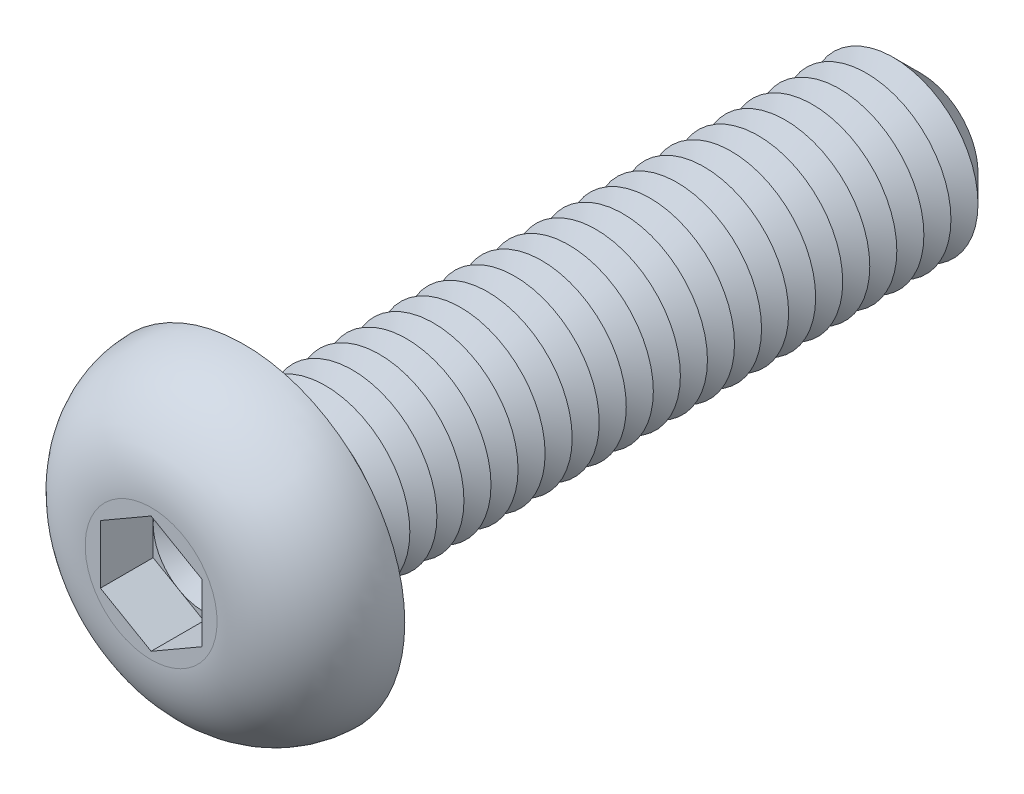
ISO-10303-21;
HEADER;
FILE_DESCRIPTION(('STEP AP214'),'2;1');
FILE_NAME('part.step','',(''),(''),'','','');
FILE_SCHEMA(('AUTOMOTIVE_DESIGN { 1 0 10303 214 1 1 1 1 }'));
ENDSEC;
DATA;
#1=APPLICATION_CONTEXT('core data for automotive mechanical design processes');
#2=APPLICATION_PROTOCOL_DEFINITION('international standard','automotive_design',2000,#1);
#3=PRODUCT_CONTEXT('',#1,'mechanical');
#4=PRODUCT('Part','Part','',(#3));
#5=PRODUCT_RELATED_PRODUCT_CATEGORY('part','',(#4));
#6=PRODUCT_DEFINITION_FORMATION('','',#4);
#7=PRODUCT_DEFINITION_CONTEXT('part definition',#1,'design');
#8=PRODUCT_DEFINITION('design','',#6,#7);
#9=PRODUCT_DEFINITION_SHAPE('','',#8);
#10=(LENGTH_UNIT() NAMED_UNIT(*) SI_UNIT(.MILLI.,.METRE.));
#11=(NAMED_UNIT(*) PLANE_ANGLE_UNIT() SI_UNIT($,.RADIAN.));
#12=(NAMED_UNIT(*) SI_UNIT($,.STERADIAN.) SOLID_ANGLE_UNIT());
#13=UNCERTAINTY_MEASURE_WITH_UNIT(LENGTH_MEASURE(1.E-05),#10,'distance_accuracy_value','');
#14=(GEOMETRIC_REPRESENTATION_CONTEXT(3) GLOBAL_UNCERTAINTY_ASSIGNED_CONTEXT((#13)) GLOBAL_UNIT_ASSIGNED_CONTEXT((#10,
#11,#12)) REPRESENTATION_CONTEXT('',''));
#15=CARTESIAN_POINT('',(0.,0.,0.));
#16=DIRECTION('',(0.,0.,1.));
#17=DIRECTION('',(1.,0.,0.));
#18=AXIS2_PLACEMENT_3D('',#15,#16,#17);
#19=CARTESIAN_POINT('',(0.,0.,1.19));
#20=DIRECTION('',(0.,0.,1.));
#21=DIRECTION('',(1.,0.,0.));
#22=AXIS2_PLACEMENT_3D('',#19,#20,#21);
#23=PLANE('',#22);
#24=CARTESIAN_POINT('',(0.,0.,1.19));
#25=DIRECTION('',(0.,0.,1.));
#26=DIRECTION('',(1.,0.,0.));
#27=AXIS2_PLACEMENT_3D('',#24,#25,#26);
#28=CIRCLE('',#27,1.5);
#29=CARTESIAN_POINT('',(1.5,0.,1.19));
#30=VERTEX_POINT('',#29);
#31=CARTESIAN_POINT('',(0.75,1.29903810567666,1.19));
#32=VERTEX_POINT('',#31);
#33=EDGE_CURVE('E117',#30,#32,#28,.T.);
#34=ORIENTED_EDGE('',*,*,#33,.F.);
#35=DIRECTION('',(0.,1.,0.));
#36=VECTOR('',#35,1.);
#37=CARTESIAN_POINT('',(1.5,-0.866025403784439,1.19));
#38=LINE('',#37,#36);
#39=CARTESIAN_POINT('',(1.5,0.86602540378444,1.19));
#40=VERTEX_POINT('',#39);
#41=EDGE_CURVE('E140',#30,#40,#38,.T.);
#42=ORIENTED_EDGE('',*,*,#41,.T.);
#43=DIRECTION('',(-0.866025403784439,0.5,0.));
#44=VECTOR('',#43,1.);
#45=CARTESIAN_POINT('',(1.5,0.86602540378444,1.19));
#46=LINE('',#45,#44);
#47=EDGE_CURVE('E135',#40,#32,#46,.T.);
#48=ORIENTED_EDGE('',*,*,#47,.T.);
#49=EDGE_LOOP('',(#34,#42,#48));
#50=FACE_BOUND('',#49,.T.);
#51=ADVANCED_FACE('F39',(#50),#23,.T.);
#52=CARTESIAN_POINT('',(0.,0.,1.19));
#53=DIRECTION('',(0.,0.,1.));
#54=DIRECTION('',(1.,0.,0.));
#55=AXIS2_PLACEMENT_3D('',#52,#53,#54);
#56=CIRCLE('',#55,1.5);
#57=CARTESIAN_POINT('',(-0.75,1.29903810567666,1.19));
#58=VERTEX_POINT('',#57);
#59=EDGE_CURVE('E11',#32,#58,#56,.T.);
#60=ORIENTED_EDGE('',*,*,#59,.F.);
#61=CARTESIAN_POINT('',(0.,1.73205080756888,1.19));
#62=VERTEX_POINT('',#61);
#63=EDGE_CURVE('E130',#32,#62,#46,.T.);
#64=ORIENTED_EDGE('',*,*,#63,.T.);
#65=DIRECTION('',(-0.866025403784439,-0.5,0.));
#66=VECTOR('',#65,1.);
#67=CARTESIAN_POINT('',(0.,1.73205080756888,1.19));
#68=LINE('',#67,#66);
#69=EDGE_CURVE('E132',#62,#58,#68,.T.);
#70=ORIENTED_EDGE('',*,*,#69,.T.);
#71=EDGE_LOOP('',(#60,#64,#70));
#72=FACE_BOUND('',#71,.T.);
#73=ADVANCED_FACE('F129',(#72),#23,.T.);
#74=CARTESIAN_POINT('',(-1.5,0.,1.19));
#75=VERTEX_POINT('',#74);
#76=EDGE_CURVE('E49',#58,#75,#56,.T.);
#77=ORIENTED_EDGE('',*,*,#76,.F.);
#78=CARTESIAN_POINT('',(-1.5,0.866025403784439,1.19));
#79=VERTEX_POINT('',#78);
#80=EDGE_CURVE('E143',#58,#79,#68,.T.);
#81=ORIENTED_EDGE('',*,*,#80,.T.);
#82=DIRECTION('',(0.,-1.,0.));
#83=VECTOR('',#82,1.);
#84=CARTESIAN_POINT('',(-1.5,0.866025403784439,1.19));
#85=LINE('',#84,#83);
#86=EDGE_CURVE('E154',#79,#75,#85,.T.);
#87=ORIENTED_EDGE('',*,*,#86,.T.);
#88=EDGE_LOOP('',(#77,#81,#87));
#89=FACE_BOUND('',#88,.T.);
#90=ADVANCED_FACE('F252',(#89),#23,.T.);
#91=CARTESIAN_POINT('',(-0.75,-1.29903810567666,1.19));
#92=VERTEX_POINT('',#91);
#93=EDGE_CURVE('E234',#75,#92,#56,.T.);
#94=ORIENTED_EDGE('',*,*,#93,.F.);
#95=CARTESIAN_POINT('',(-1.5,-0.866025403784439,1.19));
#96=VERTEX_POINT('',#95);
#97=EDGE_CURVE('E153',#75,#96,#85,.T.);
#98=ORIENTED_EDGE('',*,*,#97,.T.);
#99=DIRECTION('',(0.866025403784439,-0.5,0.));
#100=VECTOR('',#99,1.);
#101=CARTESIAN_POINT('',(-1.5,-0.866025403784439,1.19));
#102=LINE('',#101,#100);
#103=EDGE_CURVE('E159',#96,#92,#102,.T.);
#104=ORIENTED_EDGE('',*,*,#103,.T.);
#105=EDGE_LOOP('',(#94,#98,#104));
#106=FACE_BOUND('',#105,.T.);
#107=ADVANCED_FACE('F245',(#106),#23,.T.);
#108=CARTESIAN_POINT('',(0.75,-1.29903810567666,1.19));
#109=VERTEX_POINT('',#108);
#110=EDGE_CURVE('E56',#92,#109,#56,.T.);
#111=ORIENTED_EDGE('',*,*,#110,.F.);
#112=CARTESIAN_POINT('',(0.,-1.73205080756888,1.19));
#113=VERTEX_POINT('',#112);
#114=EDGE_CURVE('E158',#92,#113,#102,.T.);
#115=ORIENTED_EDGE('',*,*,#114,.T.);
#116=DIRECTION('',(0.866025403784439,0.5,0.));
#117=VECTOR('',#116,1.);
#118=CARTESIAN_POINT('',(0.,-1.73205080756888,1.19));
#119=LINE('',#118,#117);
#120=EDGE_CURVE('E164',#113,#109,#119,.T.);
#121=ORIENTED_EDGE('',*,*,#120,.T.);
#122=EDGE_LOOP('',(#111,#115,#121));
#123=FACE_BOUND('',#122,.T.);
#124=ADVANCED_FACE('F481',(#123),#23,.T.);
#125=CARTESIAN_POINT('',(0.,0.,-20.));
#126=DIRECTION('',(0.,0.,1.));
#127=DIRECTION('',(1.,0.,0.));
#128=AXIS2_PLACEMENT_3D('',#125,#126,#127);
#129=CYLINDRICAL_SURFACE('',#128,2.5);
#130=CARTESIAN_POINT('',(0.,0.,-0.400000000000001));
#131=DIRECTION('',(0.,0.,1.));
#132=DIRECTION('',(1.,0.,0.));
#133=AXIS2_PLACEMENT_3D('',#130,#131,#132);
#134=CIRCLE('',#133,2.5);
#135=CARTESIAN_POINT('',(2.5,0.,-0.400000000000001));
#136=VERTEX_POINT('',#135);
#137=EDGE_CURVE('E221',#136,#136,#134,.F.);
#138=ORIENTED_EDGE('',*,*,#137,.T.);
#139=EDGE_LOOP('',(#138));
#140=FACE_BOUND('',#139,.T.);
#141=CARTESIAN_POINT('',(0.,0.,-0.800000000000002));
#142=DIRECTION('',(0.,0.,1.));
#143=DIRECTION('',(1.,0.,0.));
#144=AXIS2_PLACEMENT_3D('',#141,#142,#143);
#145=CIRCLE('',#144,2.5);
#146=CARTESIAN_POINT('',(2.5,0.,-0.800000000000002));
#147=VERTEX_POINT('',#146);
#148=EDGE_CURVE('E149',#147,#147,#145,.T.);
#149=ORIENTED_EDGE('',*,*,#148,.T.);
#150=EDGE_LOOP('',(#149));
#151=FACE_BOUND('',#150,.T.);
#152=ADVANCED_FACE('F490',(#140,#151),#129,.T.);
#153=CARTESIAN_POINT('',(0.,4.75,0.));
#154=DIRECTION('',(0.,0.,1.));
#155=DIRECTION('',(1.,0.,0.));
#156=AXIS2_PLACEMENT_3D('',#153,#154,#155);
#157=PLANE('',#156);
#158=CARTESIAN_POINT('',(0.,0.,0.));
#159=DIRECTION('',(0.,0.,1.));
#160=DIRECTION('',(1.,0.,0.));
#161=AXIS2_PLACEMENT_3D('',#158,#159,#160);
#162=CIRCLE('',#161,2.9);
#163=CARTESIAN_POINT('',(2.9,0.,0.));
#164=VERTEX_POINT('',#163);
#165=EDGE_CURVE('E224',#164,#164,#162,.T.);
#166=ORIENTED_EDGE('',*,*,#165,.T.);
#167=EDGE_LOOP('',(#166));
#168=FACE_BOUND('',#167,.T.);
#169=CARTESIAN_POINT('',(0.,0.,0.));
#170=DIRECTION('',(0.,0.,1.));
#171=DIRECTION('',(1.,0.,0.));
#172=AXIS2_PLACEMENT_3D('',#169,#170,#171);
#173=CIRCLE('',#172,4.75);
#174=CARTESIAN_POINT('',(4.75,0.,0.));
#175=VERTEX_POINT('',#174);
#176=EDGE_CURVE('E196',#175,#175,#173,.T.);
#177=ORIENTED_EDGE('',*,*,#176,.F.);
#178=EDGE_LOOP('',(#177));
#179=FACE_BOUND('',#178,.T.);
#180=ADVANCED_FACE('F495',(#168,#179),#157,.F.);
#181=CARTESIAN_POINT('',(0.,0.,2.75));
#182=DIRECTION('',(0.,0.,-1.));
#183=DIRECTION('',(-1.,0.,0.));
#184=AXIS2_PLACEMENT_3D('',#181,#182,#183);
#185=PLANE('',#184);
#186=DIRECTION('',(-0.866025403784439,-0.5,0.));
#187=VECTOR('',#186,1.);
#188=CARTESIAN_POINT('',(0.,1.73205080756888,2.75));
#189=LINE('',#188,#187);
#190=CARTESIAN_POINT('',(0.,1.73205080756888,2.75));
#191=VERTEX_POINT('',#190);
#192=CARTESIAN_POINT('',(-1.5,0.866025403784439,2.75));
#193=VERTEX_POINT('',#192);
#194=EDGE_CURVE('E174',#191,#193,#189,.T.);
#195=ORIENTED_EDGE('',*,*,#194,.F.);
#196=DIRECTION('',(-0.866025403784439,0.5,0.));
#197=VECTOR('',#196,1.);
#198=CARTESIAN_POINT('',(1.5,0.86602540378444,2.75));
#199=LINE('',#198,#197);
#200=CARTESIAN_POINT('',(1.5,0.86602540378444,2.75));
#201=VERTEX_POINT('',#200);
#202=EDGE_CURVE('E64',#201,#191,#199,.T.);
#203=ORIENTED_EDGE('',*,*,#202,.F.);
#204=DIRECTION('',(0.,1.,0.));
#205=VECTOR('',#204,1.);
#206=CARTESIAN_POINT('',(1.5,-0.866025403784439,2.75));
#207=LINE('',#206,#205);
#208=CARTESIAN_POINT('',(1.5,-0.866025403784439,2.75));
#209=VERTEX_POINT('',#208);
#210=EDGE_CURVE('E138',#209,#201,#207,.T.);
#211=ORIENTED_EDGE('',*,*,#210,.F.);
#212=DIRECTION('',(0.866025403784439,0.5,0.));
#213=VECTOR('',#212,1.);
#214=CARTESIAN_POINT('',(0.,-1.73205080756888,2.75));
#215=LINE('',#214,#213);
#216=CARTESIAN_POINT('',(0.,-1.73205080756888,2.75));
#217=VERTEX_POINT('',#216);
#218=EDGE_CURVE('E186',#217,#209,#215,.T.);
#219=ORIENTED_EDGE('',*,*,#218,.F.);
#220=DIRECTION('',(0.866025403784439,-0.5,0.));
#221=VECTOR('',#220,1.);
#222=CARTESIAN_POINT('',(-1.5,-0.866025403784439,2.75));
#223=LINE('',#222,#221);
#224=CARTESIAN_POINT('',(-1.5,-0.866025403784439,2.75));
#225=VERTEX_POINT('',#224);
#226=EDGE_CURVE('E182',#225,#217,#223,.T.);
#227=ORIENTED_EDGE('',*,*,#226,.F.);
#228=DIRECTION('',(0.,-1.,0.));
#229=VECTOR('',#228,1.);
#230=CARTESIAN_POINT('',(-1.5,0.866025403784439,2.75));
#231=LINE('',#230,#229);
#232=EDGE_CURVE('E178',#193,#225,#231,.T.);
#233=ORIENTED_EDGE('',*,*,#232,.F.);
#234=EDGE_LOOP('',(#195,#203,#211,#219,#227,#233));
#235=FACE_BOUND('',#234,.T.);
#236=CARTESIAN_POINT('',(0.,0.,2.75));
#237=DIRECTION('',(0.,0.,1.));
#238=DIRECTION('',(1.,0.,0.));
#239=AXIS2_PLACEMENT_3D('',#236,#237,#238);
#240=CIRCLE('',#239,1.95044646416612);
#241=CARTESIAN_POINT('',(1.95044646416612,0.,2.75));
#242=VERTEX_POINT('',#241);
#243=EDGE_CURVE('E213',#242,#242,#240,.T.);
#244=ORIENTED_EDGE('',*,*,#243,.T.);
#245=EDGE_LOOP('',(#244));
#246=FACE_BOUND('',#245,.T.);
#247=ADVANCED_FACE('F261',(#235,#246),#185,.F.);
#248=CARTESIAN_POINT('',(0.,0.,-0.0500000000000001));
#249=DIRECTION('',(0.,0.,1.));
#250=DIRECTION('',(1.,0.,0.));
#251=AXIS2_PLACEMENT_3D('',#248,#249,#250);
#252=DEGENERATE_TOROIDAL_SURFACE('',#251,1.95044646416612,2.8,.T.);
#253=ORIENTED_EDGE('',*,*,#243,.F.);
#254=EDGE_LOOP('',(#253));
#255=FACE_BOUND('',#254,.T.);
#256=ORIENTED_EDGE('',*,*,#176,.T.);
#257=EDGE_LOOP('',(#256));
#258=FACE_BOUND('',#257,.T.);
#259=ADVANCED_FACE('F511',(#255,#258),#252,.T.);
#260=CARTESIAN_POINT('',(1.5,0.86602540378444,1.19));
#261=DIRECTION('',(0.5,0.866025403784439,0.));
#262=DIRECTION('',(-0.866025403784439,0.5,0.));
#263=AXIS2_PLACEMENT_3D('',#260,#261,#262);
#264=PLANE('',#263);
#265=ORIENTED_EDGE('',*,*,#202,.T.);
#266=DIRECTION('',(0.,0.,1.));
#267=VECTOR('',#266,1.);
#268=CARTESIAN_POINT('',(0.,1.73205080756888,1.19));
#269=LINE('',#268,#267);
#270=EDGE_CURVE('E136',#62,#191,#269,.T.);
#271=ORIENTED_EDGE('',*,*,#270,.F.);
#272=ORIENTED_EDGE('',*,*,#63,.F.);
#273=ORIENTED_EDGE('',*,*,#47,.F.);
#274=DIRECTION('',(0.,0.,1.));
#275=VECTOR('',#274,1.);
#276=CARTESIAN_POINT('',(1.5,0.86602540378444,1.19));
#277=LINE('',#276,#275);
#278=EDGE_CURVE('E193',#40,#201,#277,.T.);
#279=ORIENTED_EDGE('',*,*,#278,.T.);
#280=EDGE_LOOP('',(#265,#271,#272,#273,#279));
#281=FACE_BOUND('',#280,.T.);
#282=ADVANCED_FACE('F134',(#281),#264,.F.);
#283=CARTESIAN_POINT('',(1.5,-0.866025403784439,1.19));
#284=DIRECTION('',(1.,0.,0.));
#285=DIRECTION('',(0.,1.,0.));
#286=AXIS2_PLACEMENT_3D('',#283,#284,#285);
#287=PLANE('',#286);
#288=ORIENTED_EDGE('',*,*,#210,.T.);
#289=ORIENTED_EDGE('',*,*,#278,.F.);
#290=ORIENTED_EDGE('',*,*,#41,.F.);
#291=CARTESIAN_POINT('',(1.5,-0.866025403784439,1.19));
#292=VERTEX_POINT('',#291);
#293=EDGE_CURVE('E168',#292,#30,#38,.T.);
#294=ORIENTED_EDGE('',*,*,#293,.F.);
#295=DIRECTION('',(0.,0.,1.));
#296=VECTOR('',#295,1.);
#297=CARTESIAN_POINT('',(1.5,-0.866025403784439,1.19));
#298=LINE('',#297,#296);
#299=EDGE_CURVE('E197',#292,#209,#298,.T.);
#300=ORIENTED_EDGE('',*,*,#299,.T.);
#301=EDGE_LOOP('',(#288,#289,#290,#294,#300));
#302=FACE_BOUND('',#301,.T.);
#303=ADVANCED_FACE('F504',(#302),#287,.F.);
#304=CARTESIAN_POINT('',(0.,-1.73205080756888,1.19));
#305=DIRECTION('',(0.5,-0.866025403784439,0.));
#306=DIRECTION('',(0.866025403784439,0.5,0.));
#307=AXIS2_PLACEMENT_3D('',#304,#305,#306);
#308=PLANE('',#307);
#309=ORIENTED_EDGE('',*,*,#218,.T.);
#310=ORIENTED_EDGE('',*,*,#299,.F.);
#311=EDGE_CURVE('E163',#109,#292,#119,.T.);
#312=ORIENTED_EDGE('',*,*,#311,.F.);
#313=ORIENTED_EDGE('',*,*,#120,.F.);
#314=DIRECTION('',(0.,0.,1.));
#315=VECTOR('',#314,1.);
#316=CARTESIAN_POINT('',(0.,-1.73205080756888,1.19));
#317=LINE('',#316,#315);
#318=EDGE_CURVE('E200',#113,#217,#317,.T.);
#319=ORIENTED_EDGE('',*,*,#318,.T.);
#320=EDGE_LOOP('',(#309,#310,#312,#313,#319));
#321=FACE_BOUND('',#320,.T.);
#322=ADVANCED_FACE('F499',(#321),#308,.F.);
#323=CARTESIAN_POINT('',(-1.5,-0.866025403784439,1.19));
#324=DIRECTION('',(-0.5,-0.866025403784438,0.));
#325=DIRECTION('',(0.866025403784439,-0.5,0.));
#326=AXIS2_PLACEMENT_3D('',#323,#324,#325);
#327=PLANE('',#326);
#328=ORIENTED_EDGE('',*,*,#226,.T.);
#329=ORIENTED_EDGE('',*,*,#318,.F.);
#330=ORIENTED_EDGE('',*,*,#114,.F.);
#331=ORIENTED_EDGE('',*,*,#103,.F.);
#332=DIRECTION('',(0.,0.,1.));
#333=VECTOR('',#332,1.);
#334=CARTESIAN_POINT('',(-1.5,-0.866025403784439,1.19));
#335=LINE('',#334,#333);
#336=EDGE_CURVE('E203',#96,#225,#335,.T.);
#337=ORIENTED_EDGE('',*,*,#336,.T.);
#338=EDGE_LOOP('',(#328,#329,#330,#331,#337));
#339=FACE_BOUND('',#338,.T.);
#340=ADVANCED_FACE('F266',(#339),#327,.F.);
#341=CARTESIAN_POINT('',(-1.5,0.866025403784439,1.19));
#342=DIRECTION('',(-1.,0.,0.));
#343=DIRECTION('',(0.,-1.,0.));
#344=AXIS2_PLACEMENT_3D('',#341,#342,#343);
#345=PLANE('',#344);
#346=ORIENTED_EDGE('',*,*,#232,.T.);
#347=ORIENTED_EDGE('',*,*,#336,.F.);
#348=ORIENTED_EDGE('',*,*,#97,.F.);
#349=ORIENTED_EDGE('',*,*,#86,.F.);
#350=DIRECTION('',(0.,0.,1.));
#351=VECTOR('',#350,1.);
#352=CARTESIAN_POINT('',(-1.5,0.866025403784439,1.19));
#353=LINE('',#352,#351);
#354=EDGE_CURVE('E206',#79,#193,#353,.T.);
#355=ORIENTED_EDGE('',*,*,#354,.T.);
#356=EDGE_LOOP('',(#346,#347,#348,#349,#355));
#357=FACE_BOUND('',#356,.T.);
#358=ADVANCED_FACE('F250',(#357),#345,.F.);
#359=CARTESIAN_POINT('',(0.,1.73205080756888,1.19));
#360=DIRECTION('',(-0.5,0.866025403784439,0.));
#361=DIRECTION('',(-0.866025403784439,-0.5,0.));
#362=AXIS2_PLACEMENT_3D('',#359,#360,#361);
#363=PLANE('',#362);
#364=ORIENTED_EDGE('',*,*,#194,.T.);
#365=ORIENTED_EDGE('',*,*,#354,.F.);
#366=ORIENTED_EDGE('',*,*,#80,.F.);
#367=ORIENTED_EDGE('',*,*,#69,.F.);
#368=ORIENTED_EDGE('',*,*,#270,.T.);
#369=EDGE_LOOP('',(#364,#365,#366,#367,#368));
#370=FACE_BOUND('',#369,.T.);
#371=ADVANCED_FACE('F255',(#370),#363,.F.);
#372=EDGE_CURVE('E43',#109,#30,#56,.T.);
#373=ORIENTED_EDGE('',*,*,#372,.F.);
#374=ORIENTED_EDGE('',*,*,#311,.T.);
#375=ORIENTED_EDGE('',*,*,#293,.T.);
#376=EDGE_LOOP('',(#373,#374,#375));
#377=FACE_BOUND('',#376,.T.);
#378=ADVANCED_FACE('F472',(#377),#23,.T.);
#379=CARTESIAN_POINT('',(0.,0.,-0.800000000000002));
#380=DIRECTION('',(0.,0.,1.));
#381=DIRECTION('',(1.,0.,0.));
#382=AXIS2_PLACEMENT_3D('',#379,#380,#381);
#383=CONICAL_SURFACE('',#382,2.5,1.0471975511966);
#384=CARTESIAN_POINT('',(0.,0.,-1.2));
#385=DIRECTION('',(0.,0.,1.));
#386=DIRECTION('',(1.,0.,0.));
#387=AXIS2_PLACEMENT_3D('',#384,#385,#386);
#388=CIRCLE('',#387,1.80717967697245);
#389=CARTESIAN_POINT('',(1.80717967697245,0.,-1.2));
#390=VERTEX_POINT('',#389);
#391=EDGE_CURVE('E272',#390,#390,#388,.T.);
#392=ORIENTED_EDGE('',*,*,#391,.T.);
#393=EDGE_LOOP('',(#392));
#394=FACE_BOUND('',#393,.T.);
#395=ORIENTED_EDGE('',*,*,#148,.F.);
#396=EDGE_LOOP('',(#395));
#397=FACE_BOUND('',#396,.T.);
#398=ADVANCED_FACE('F479',(#394,#397),#383,.T.);
#399=CARTESIAN_POINT('',(0.,0.,-1.2));
#400=DIRECTION('',(0.,0.,-1.));
#401=DIRECTION('',(-1.,0.,0.));
#402=AXIS2_PLACEMENT_3D('',#399,#400,#401);
#403=CONICAL_SURFACE('',#402,1.80717967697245,1.04719755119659);
#404=CARTESIAN_POINT('',(0.,0.,-1.6));
#405=DIRECTION('',(0.,0.,1.));
#406=DIRECTION('',(1.,0.,0.));
#407=AXIS2_PLACEMENT_3D('',#404,#405,#406);
#408=CIRCLE('',#407,2.5);
#409=CARTESIAN_POINT('',(2.5,0.,-1.6));
#410=VERTEX_POINT('',#409);
#411=EDGE_CURVE('E274',#410,#410,#408,.T.);
#412=ORIENTED_EDGE('',*,*,#411,.T.);
#413=EDGE_LOOP('',(#412));
#414=FACE_BOUND('',#413,.T.);
#415=ORIENTED_EDGE('',*,*,#391,.F.);
#416=EDGE_LOOP('',(#415));
#417=FACE_BOUND('',#416,.T.);
#418=ADVANCED_FACE('F486',(#414,#417),#403,.T.);
#419=CARTESIAN_POINT('',(0.,0.,-1.6));
#420=DIRECTION('',(0.,0.,1.));
#421=DIRECTION('',(1.,0.,0.));
#422=AXIS2_PLACEMENT_3D('',#419,#420,#421);
#423=CONICAL_SURFACE('',#422,2.5,1.0471975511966);
#424=CARTESIAN_POINT('',(0.,0.,-2.));
#425=DIRECTION('',(0.,0.,1.));
#426=DIRECTION('',(1.,0.,0.));
#427=AXIS2_PLACEMENT_3D('',#424,#425,#426);
#428=CIRCLE('',#427,1.80717967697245);
#429=CARTESIAN_POINT('',(1.80717967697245,0.,-2.));
#430=VERTEX_POINT('',#429);
#431=EDGE_CURVE('E281',#430,#430,#428,.T.);
#432=ORIENTED_EDGE('',*,*,#431,.T.);
#433=EDGE_LOOP('',(#432));
#434=FACE_BOUND('',#433,.T.);
#435=ORIENTED_EDGE('',*,*,#411,.F.);
#436=EDGE_LOOP('',(#435));
#437=FACE_BOUND('',#436,.T.);
#438=ADVANCED_FACE('F1059',(#434,#437),#423,.T.);
#439=CARTESIAN_POINT('',(0.,0.,-2.));
#440=DIRECTION('',(0.,0.,-1.));
#441=DIRECTION('',(-1.,0.,0.));
#442=AXIS2_PLACEMENT_3D('',#439,#440,#441);
#443=CONICAL_SURFACE('',#442,1.80717967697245,1.04719755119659);
#444=CARTESIAN_POINT('',(0.,0.,-2.4));
#445=DIRECTION('',(0.,0.,1.));
#446=DIRECTION('',(1.,0.,0.));
#447=AXIS2_PLACEMENT_3D('',#444,#445,#446);
#448=CIRCLE('',#447,2.5);
#449=CARTESIAN_POINT('',(2.5,0.,-2.4));
#450=VERTEX_POINT('',#449);
#451=EDGE_CURVE('E287',#450,#450,#448,.T.);
#452=ORIENTED_EDGE('',*,*,#451,.T.);
#453=EDGE_LOOP('',(#452));
#454=FACE_BOUND('',#453,.T.);
#455=ORIENTED_EDGE('',*,*,#431,.F.);
#456=EDGE_LOOP('',(#455));
#457=FACE_BOUND('',#456,.T.);
#458=ADVANCED_FACE('F1049',(#454,#457),#443,.T.);
#459=CARTESIAN_POINT('',(0.,0.,-2.4));
#460=DIRECTION('',(0.,0.,1.));
#461=DIRECTION('',(1.,0.,0.));
#462=AXIS2_PLACEMENT_3D('',#459,#460,#461);
#463=CONICAL_SURFACE('',#462,2.5,1.0471975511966);
#464=CARTESIAN_POINT('',(0.,0.,-2.8));
#465=DIRECTION('',(0.,0.,1.));
#466=DIRECTION('',(1.,0.,0.));
#467=AXIS2_PLACEMENT_3D('',#464,#465,#466);
#468=CIRCLE('',#467,1.80717967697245);
#469=CARTESIAN_POINT('',(1.80717967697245,0.,-2.8));
#470=VERTEX_POINT('',#469);
#471=EDGE_CURVE('E290',#470,#470,#468,.T.);
#472=ORIENTED_EDGE('',*,*,#471,.T.);
#473=EDGE_LOOP('',(#472));
#474=FACE_BOUND('',#473,.T.);
#475=ORIENTED_EDGE('',*,*,#451,.F.);
#476=EDGE_LOOP('',(#475));
#477=FACE_BOUND('',#476,.T.);
#478=ADVANCED_FACE('F1039',(#474,#477),#463,.T.);
#479=CARTESIAN_POINT('',(0.,0.,-2.8));
#480=DIRECTION('',(0.,0.,-1.));
#481=DIRECTION('',(-1.,0.,0.));
#482=AXIS2_PLACEMENT_3D('',#479,#480,#481);
#483=CONICAL_SURFACE('',#482,1.80717967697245,1.04719755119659);
#484=CARTESIAN_POINT('',(0.,0.,-3.2));
#485=DIRECTION('',(0.,0.,1.));
#486=DIRECTION('',(1.,0.,0.));
#487=AXIS2_PLACEMENT_3D('',#484,#485,#486);
#488=CIRCLE('',#487,2.5);
#489=CARTESIAN_POINT('',(2.5,0.,-3.2));
#490=VERTEX_POINT('',#489);
#491=EDGE_CURVE('E294',#490,#490,#488,.T.);
#492=ORIENTED_EDGE('',*,*,#491,.T.);
#493=EDGE_LOOP('',(#492));
#494=FACE_BOUND('',#493,.T.);
#495=ORIENTED_EDGE('',*,*,#471,.F.);
#496=EDGE_LOOP('',(#495));
#497=FACE_BOUND('',#496,.T.);
#498=ADVANCED_FACE('F1029',(#494,#497),#483,.T.);
#499=CARTESIAN_POINT('',(0.,0.,-3.2));
#500=DIRECTION('',(0.,0.,1.));
#501=DIRECTION('',(1.,0.,0.));
#502=AXIS2_PLACEMENT_3D('',#499,#500,#501);
#503=CONICAL_SURFACE('',#502,2.5,1.0471975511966);
#504=CARTESIAN_POINT('',(0.,0.,-3.6));
#505=DIRECTION('',(0.,0.,1.));
#506=DIRECTION('',(1.,0.,0.));
#507=AXIS2_PLACEMENT_3D('',#504,#505,#506);
#508=CIRCLE('',#507,1.80717967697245);
#509=CARTESIAN_POINT('',(1.80717967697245,0.,-3.6));
#510=VERTEX_POINT('',#509);
#511=EDGE_CURVE('E297',#510,#510,#508,.T.);
#512=ORIENTED_EDGE('',*,*,#511,.T.);
#513=EDGE_LOOP('',(#512));
#514=FACE_BOUND('',#513,.T.);
#515=ORIENTED_EDGE('',*,*,#491,.F.);
#516=EDGE_LOOP('',(#515));
#517=FACE_BOUND('',#516,.T.);
#518=ADVANCED_FACE('F1019',(#514,#517),#503,.T.);
#519=CARTESIAN_POINT('',(0.,0.,-3.6));
#520=DIRECTION('',(0.,0.,-1.));
#521=DIRECTION('',(-1.,0.,0.));
#522=AXIS2_PLACEMENT_3D('',#519,#520,#521);
#523=CONICAL_SURFACE('',#522,1.80717967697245,1.04719755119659);
#524=CARTESIAN_POINT('',(0.,0.,-4.));
#525=DIRECTION('',(0.,0.,1.));
#526=DIRECTION('',(1.,0.,0.));
#527=AXIS2_PLACEMENT_3D('',#524,#525,#526);
#528=CIRCLE('',#527,2.5);
#529=CARTESIAN_POINT('',(2.5,0.,-4.));
#530=VERTEX_POINT('',#529);
#531=EDGE_CURVE('E301',#530,#530,#528,.T.);
#532=ORIENTED_EDGE('',*,*,#531,.T.);
#533=EDGE_LOOP('',(#532));
#534=FACE_BOUND('',#533,.T.);
#535=ORIENTED_EDGE('',*,*,#511,.F.);
#536=EDGE_LOOP('',(#535));
#537=FACE_BOUND('',#536,.T.);
#538=ADVANCED_FACE('F1009',(#534,#537),#523,.T.);
#539=CARTESIAN_POINT('',(0.,0.,-4.));
#540=DIRECTION('',(0.,0.,1.));
#541=DIRECTION('',(1.,0.,0.));
#542=AXIS2_PLACEMENT_3D('',#539,#540,#541);
#543=CONICAL_SURFACE('',#542,2.5,1.0471975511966);
#544=CARTESIAN_POINT('',(0.,0.,-4.4));
#545=DIRECTION('',(0.,0.,1.));
#546=DIRECTION('',(1.,0.,0.));
#547=AXIS2_PLACEMENT_3D('',#544,#545,#546);
#548=CIRCLE('',#547,1.80717967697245);
#549=CARTESIAN_POINT('',(1.80717967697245,0.,-4.4));
#550=VERTEX_POINT('',#549);
#551=EDGE_CURVE('E305',#550,#550,#548,.T.);
#552=ORIENTED_EDGE('',*,*,#551,.T.);
#553=EDGE_LOOP('',(#552));
#554=FACE_BOUND('',#553,.T.);
#555=ORIENTED_EDGE('',*,*,#531,.F.);
#556=EDGE_LOOP('',(#555));
#557=FACE_BOUND('',#556,.T.);
#558=ADVANCED_FACE('F999',(#554,#557),#543,.T.);
#559=CARTESIAN_POINT('',(0.,0.,-4.4));
#560=DIRECTION('',(0.,0.,-1.));
#561=DIRECTION('',(-1.,0.,0.));
#562=AXIS2_PLACEMENT_3D('',#559,#560,#561);
#563=CONICAL_SURFACE('',#562,1.80717967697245,1.04719755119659);
#564=CARTESIAN_POINT('',(0.,0.,-4.8));
#565=DIRECTION('',(0.,0.,1.));
#566=DIRECTION('',(1.,0.,0.));
#567=AXIS2_PLACEMENT_3D('',#564,#565,#566);
#568=CIRCLE('',#567,2.5);
#569=CARTESIAN_POINT('',(2.5,0.,-4.8));
#570=VERTEX_POINT('',#569);
#571=EDGE_CURVE('E309',#570,#570,#568,.T.);
#572=ORIENTED_EDGE('',*,*,#571,.T.);
#573=EDGE_LOOP('',(#572));
#574=FACE_BOUND('',#573,.T.);
#575=ORIENTED_EDGE('',*,*,#551,.F.);
#576=EDGE_LOOP('',(#575));
#577=FACE_BOUND('',#576,.T.);
#578=ADVANCED_FACE('F989',(#574,#577),#563,.T.);
#579=CARTESIAN_POINT('',(0.,0.,-4.8));
#580=DIRECTION('',(0.,0.,1.));
#581=DIRECTION('',(1.,0.,0.));
#582=AXIS2_PLACEMENT_3D('',#579,#580,#581);
#583=CONICAL_SURFACE('',#582,2.5,1.0471975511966);
#584=CARTESIAN_POINT('',(0.,0.,-5.2));
#585=DIRECTION('',(0.,0.,1.));
#586=DIRECTION('',(1.,0.,0.));
#587=AXIS2_PLACEMENT_3D('',#584,#585,#586);
#588=CIRCLE('',#587,1.80717967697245);
#589=CARTESIAN_POINT('',(1.80717967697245,0.,-5.2));
#590=VERTEX_POINT('',#589);
#591=EDGE_CURVE('E313',#590,#590,#588,.T.);
#592=ORIENTED_EDGE('',*,*,#591,.T.);
#593=EDGE_LOOP('',(#592));
#594=FACE_BOUND('',#593,.T.);
#595=ORIENTED_EDGE('',*,*,#571,.F.);
#596=EDGE_LOOP('',(#595));
#597=FACE_BOUND('',#596,.T.);
#598=ADVANCED_FACE('F979',(#594,#597),#583,.T.);
#599=CARTESIAN_POINT('',(0.,0.,-5.2));
#600=DIRECTION('',(0.,0.,-1.));
#601=DIRECTION('',(-1.,0.,0.));
#602=AXIS2_PLACEMENT_3D('',#599,#600,#601);
#603=CONICAL_SURFACE('',#602,1.80717967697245,1.04719755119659);
#604=CARTESIAN_POINT('',(0.,0.,-5.6));
#605=DIRECTION('',(0.,0.,1.));
#606=DIRECTION('',(1.,0.,0.));
#607=AXIS2_PLACEMENT_3D('',#604,#605,#606);
#608=CIRCLE('',#607,2.5);
#609=CARTESIAN_POINT('',(2.5,0.,-5.6));
#610=VERTEX_POINT('',#609);
#611=EDGE_CURVE('E317',#610,#610,#608,.T.);
#612=ORIENTED_EDGE('',*,*,#611,.T.);
#613=EDGE_LOOP('',(#612));
#614=FACE_BOUND('',#613,.T.);
#615=ORIENTED_EDGE('',*,*,#591,.F.);
#616=EDGE_LOOP('',(#615));
#617=FACE_BOUND('',#616,.T.);
#618=ADVANCED_FACE('F969',(#614,#617),#603,.T.);
#619=CARTESIAN_POINT('',(0.,0.,-5.6));
#620=DIRECTION('',(0.,0.,1.));
#621=DIRECTION('',(1.,0.,0.));
#622=AXIS2_PLACEMENT_3D('',#619,#620,#621);
#623=CONICAL_SURFACE('',#622,2.5,1.0471975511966);
#624=CARTESIAN_POINT('',(0.,0.,-6.));
#625=DIRECTION('',(0.,0.,1.));
#626=DIRECTION('',(1.,0.,0.));
#627=AXIS2_PLACEMENT_3D('',#624,#625,#626);
#628=CIRCLE('',#627,1.80717967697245);
#629=CARTESIAN_POINT('',(1.80717967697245,0.,-6.));
#630=VERTEX_POINT('',#629);
#631=EDGE_CURVE('E321',#630,#630,#628,.T.);
#632=ORIENTED_EDGE('',*,*,#631,.T.);
#633=EDGE_LOOP('',(#632));
#634=FACE_BOUND('',#633,.T.);
#635=ORIENTED_EDGE('',*,*,#611,.F.);
#636=EDGE_LOOP('',(#635));
#637=FACE_BOUND('',#636,.T.);
#638=ADVANCED_FACE('F959',(#634,#637),#623,.T.);
#639=CARTESIAN_POINT('',(0.,0.,-6.));
#640=DIRECTION('',(0.,0.,-1.));
#641=DIRECTION('',(-1.,0.,0.));
#642=AXIS2_PLACEMENT_3D('',#639,#640,#641);
#643=CONICAL_SURFACE('',#642,1.80717967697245,1.04719755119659);
#644=CARTESIAN_POINT('',(0.,0.,-6.4));
#645=DIRECTION('',(0.,0.,1.));
#646=DIRECTION('',(1.,0.,0.));
#647=AXIS2_PLACEMENT_3D('',#644,#645,#646);
#648=CIRCLE('',#647,2.5);
#649=CARTESIAN_POINT('',(2.5,0.,-6.4));
#650=VERTEX_POINT('',#649);
#651=EDGE_CURVE('E324',#650,#650,#648,.T.);
#652=ORIENTED_EDGE('',*,*,#651,.T.);
#653=EDGE_LOOP('',(#652));
#654=FACE_BOUND('',#653,.T.);
#655=ORIENTED_EDGE('',*,*,#631,.F.);
#656=EDGE_LOOP('',(#655));
#657=FACE_BOUND('',#656,.T.);
#658=ADVANCED_FACE('F949',(#654,#657),#643,.T.);
#659=CARTESIAN_POINT('',(0.,0.,-6.4));
#660=DIRECTION('',(0.,0.,1.));
#661=DIRECTION('',(1.,0.,0.));
#662=AXIS2_PLACEMENT_3D('',#659,#660,#661);
#663=CONICAL_SURFACE('',#662,2.5,1.0471975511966);
#664=CARTESIAN_POINT('',(0.,0.,-6.8));
#665=DIRECTION('',(0.,0.,1.));
#666=DIRECTION('',(1.,0.,0.));
#667=AXIS2_PLACEMENT_3D('',#664,#665,#666);
#668=CIRCLE('',#667,1.80717967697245);
#669=CARTESIAN_POINT('',(1.80717967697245,0.,-6.8));
#670=VERTEX_POINT('',#669);
#671=EDGE_CURVE('E328',#670,#670,#668,.T.);
#672=ORIENTED_EDGE('',*,*,#671,.T.);
#673=EDGE_LOOP('',(#672));
#674=FACE_BOUND('',#673,.T.);
#675=ORIENTED_EDGE('',*,*,#651,.F.);
#676=EDGE_LOOP('',(#675));
#677=FACE_BOUND('',#676,.T.);
#678=ADVANCED_FACE('F939',(#674,#677),#663,.T.);
#679=CARTESIAN_POINT('',(0.,0.,-6.8));
#680=DIRECTION('',(0.,0.,-1.));
#681=DIRECTION('',(-1.,0.,0.));
#682=AXIS2_PLACEMENT_3D('',#679,#680,#681);
#683=CONICAL_SURFACE('',#682,1.80717967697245,1.04719755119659);
#684=CARTESIAN_POINT('',(0.,0.,-7.2));
#685=DIRECTION('',(0.,0.,1.));
#686=DIRECTION('',(1.,0.,0.));
#687=AXIS2_PLACEMENT_3D('',#684,#685,#686);
#688=CIRCLE('',#687,2.5);
#689=CARTESIAN_POINT('',(2.5,0.,-7.2));
#690=VERTEX_POINT('',#689);
#691=EDGE_CURVE('E332',#690,#690,#688,.T.);
#692=ORIENTED_EDGE('',*,*,#691,.T.);
#693=EDGE_LOOP('',(#692));
#694=FACE_BOUND('',#693,.T.);
#695=ORIENTED_EDGE('',*,*,#671,.F.);
#696=EDGE_LOOP('',(#695));
#697=FACE_BOUND('',#696,.T.);
#698=ADVANCED_FACE('F929',(#694,#697),#683,.T.);
#699=CARTESIAN_POINT('',(0.,0.,-7.2));
#700=DIRECTION('',(0.,0.,1.));
#701=DIRECTION('',(1.,0.,0.));
#702=AXIS2_PLACEMENT_3D('',#699,#700,#701);
#703=CONICAL_SURFACE('',#702,2.5,1.0471975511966);
#704=CARTESIAN_POINT('',(0.,0.,-7.6));
#705=DIRECTION('',(0.,0.,1.));
#706=DIRECTION('',(1.,0.,0.));
#707=AXIS2_PLACEMENT_3D('',#704,#705,#706);
#708=CIRCLE('',#707,1.80717967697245);
#709=CARTESIAN_POINT('',(1.80717967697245,0.,-7.6));
#710=VERTEX_POINT('',#709);
#711=EDGE_CURVE('E336',#710,#710,#708,.T.);
#712=ORIENTED_EDGE('',*,*,#711,.T.);
#713=EDGE_LOOP('',(#712));
#714=FACE_BOUND('',#713,.T.);
#715=ORIENTED_EDGE('',*,*,#691,.F.);
#716=EDGE_LOOP('',(#715));
#717=FACE_BOUND('',#716,.T.);
#718=ADVANCED_FACE('F919',(#714,#717),#703,.T.);
#719=CARTESIAN_POINT('',(0.,0.,-7.6));
#720=DIRECTION('',(0.,0.,-1.));
#721=DIRECTION('',(-1.,0.,0.));
#722=AXIS2_PLACEMENT_3D('',#719,#720,#721);
#723=CONICAL_SURFACE('',#722,1.80717967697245,1.04719755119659);
#724=CARTESIAN_POINT('',(0.,0.,-8.));
#725=DIRECTION('',(0.,0.,1.));
#726=DIRECTION('',(1.,0.,0.));
#727=AXIS2_PLACEMENT_3D('',#724,#725,#726);
#728=CIRCLE('',#727,2.5);
#729=CARTESIAN_POINT('',(2.5,0.,-8.));
#730=VERTEX_POINT('',#729);
#731=EDGE_CURVE('E340',#730,#730,#728,.T.);
#732=ORIENTED_EDGE('',*,*,#731,.T.);
#733=EDGE_LOOP('',(#732));
#734=FACE_BOUND('',#733,.T.);
#735=ORIENTED_EDGE('',*,*,#711,.F.);
#736=EDGE_LOOP('',(#735));
#737=FACE_BOUND('',#736,.T.);
#738=ADVANCED_FACE('F909',(#734,#737),#723,.T.);
#739=CARTESIAN_POINT('',(0.,0.,-8.));
#740=DIRECTION('',(0.,0.,1.));
#741=DIRECTION('',(1.,0.,0.));
#742=AXIS2_PLACEMENT_3D('',#739,#740,#741);
#743=CONICAL_SURFACE('',#742,2.5,1.0471975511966);
#744=CARTESIAN_POINT('',(0.,0.,-8.4));
#745=DIRECTION('',(0.,0.,1.));
#746=DIRECTION('',(1.,0.,0.));
#747=AXIS2_PLACEMENT_3D('',#744,#745,#746);
#748=CIRCLE('',#747,1.80717967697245);
#749=CARTESIAN_POINT('',(1.80717967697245,0.,-8.4));
#750=VERTEX_POINT('',#749);
#751=EDGE_CURVE('E344',#750,#750,#748,.T.);
#752=ORIENTED_EDGE('',*,*,#751,.T.);
#753=EDGE_LOOP('',(#752));
#754=FACE_BOUND('',#753,.T.);
#755=ORIENTED_EDGE('',*,*,#731,.F.);
#756=EDGE_LOOP('',(#755));
#757=FACE_BOUND('',#756,.T.);
#758=ADVANCED_FACE('F899',(#754,#757),#743,.T.);
#759=CARTESIAN_POINT('',(0.,0.,-8.4));
#760=DIRECTION('',(0.,0.,-1.));
#761=DIRECTION('',(-1.,0.,0.));
#762=AXIS2_PLACEMENT_3D('',#759,#760,#761);
#763=CONICAL_SURFACE('',#762,1.80717967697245,1.04719755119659);
#764=CARTESIAN_POINT('',(0.,0.,-8.8));
#765=DIRECTION('',(0.,0.,1.));
#766=DIRECTION('',(1.,0.,0.));
#767=AXIS2_PLACEMENT_3D('',#764,#765,#766);
#768=CIRCLE('',#767,2.5);
#769=CARTESIAN_POINT('',(2.5,0.,-8.8));
#770=VERTEX_POINT('',#769);
#771=EDGE_CURVE('E348',#770,#770,#768,.T.);
#772=ORIENTED_EDGE('',*,*,#771,.T.);
#773=EDGE_LOOP('',(#772));
#774=FACE_BOUND('',#773,.T.);
#775=ORIENTED_EDGE('',*,*,#751,.F.);
#776=EDGE_LOOP('',(#775));
#777=FACE_BOUND('',#776,.T.);
#778=ADVANCED_FACE('F889',(#774,#777),#763,.T.);
#779=CARTESIAN_POINT('',(0.,0.,-8.8));
#780=DIRECTION('',(0.,0.,1.));
#781=DIRECTION('',(1.,0.,0.));
#782=AXIS2_PLACEMENT_3D('',#779,#780,#781);
#783=CONICAL_SURFACE('',#782,2.5,1.0471975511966);
#784=CARTESIAN_POINT('',(0.,0.,-9.2));
#785=DIRECTION('',(0.,0.,1.));
#786=DIRECTION('',(1.,0.,0.));
#787=AXIS2_PLACEMENT_3D('',#784,#785,#786);
#788=CIRCLE('',#787,1.80717967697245);
#789=CARTESIAN_POINT('',(1.80717967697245,0.,-9.2));
#790=VERTEX_POINT('',#789);
#791=EDGE_CURVE('E352',#790,#790,#788,.T.);
#792=ORIENTED_EDGE('',*,*,#791,.T.);
#793=EDGE_LOOP('',(#792));
#794=FACE_BOUND('',#793,.T.);
#795=ORIENTED_EDGE('',*,*,#771,.F.);
#796=EDGE_LOOP('',(#795));
#797=FACE_BOUND('',#796,.T.);
#798=ADVANCED_FACE('F879',(#794,#797),#783,.T.);
#799=CARTESIAN_POINT('',(0.,0.,-9.2));
#800=DIRECTION('',(0.,0.,-1.));
#801=DIRECTION('',(-1.,0.,0.));
#802=AXIS2_PLACEMENT_3D('',#799,#800,#801);
#803=CONICAL_SURFACE('',#802,1.80717967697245,1.04719755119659);
#804=CARTESIAN_POINT('',(0.,0.,-9.6));
#805=DIRECTION('',(0.,0.,1.));
#806=DIRECTION('',(1.,0.,0.));
#807=AXIS2_PLACEMENT_3D('',#804,#805,#806);
#808=CIRCLE('',#807,2.5);
#809=CARTESIAN_POINT('',(2.5,0.,-9.6));
#810=VERTEX_POINT('',#809);
#811=EDGE_CURVE('E356',#810,#810,#808,.T.);
#812=ORIENTED_EDGE('',*,*,#811,.T.);
#813=EDGE_LOOP('',(#812));
#814=FACE_BOUND('',#813,.T.);
#815=ORIENTED_EDGE('',*,*,#791,.F.);
#816=EDGE_LOOP('',(#815));
#817=FACE_BOUND('',#816,.T.);
#818=ADVANCED_FACE('F869',(#814,#817),#803,.T.);
#819=CARTESIAN_POINT('',(0.,0.,-9.6));
#820=DIRECTION('',(0.,0.,1.));
#821=DIRECTION('',(1.,0.,0.));
#822=AXIS2_PLACEMENT_3D('',#819,#820,#821);
#823=CONICAL_SURFACE('',#822,2.5,1.0471975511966);
#824=CARTESIAN_POINT('',(0.,0.,-10.));
#825=DIRECTION('',(0.,0.,1.));
#826=DIRECTION('',(1.,0.,0.));
#827=AXIS2_PLACEMENT_3D('',#824,#825,#826);
#828=CIRCLE('',#827,1.80717967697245);
#829=CARTESIAN_POINT('',(1.80717967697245,0.,-10.));
#830=VERTEX_POINT('',#829);
#831=EDGE_CURVE('E360',#830,#830,#828,.T.);
#832=ORIENTED_EDGE('',*,*,#831,.T.);
#833=EDGE_LOOP('',(#832));
#834=FACE_BOUND('',#833,.T.);
#835=ORIENTED_EDGE('',*,*,#811,.F.);
#836=EDGE_LOOP('',(#835));
#837=FACE_BOUND('',#836,.T.);
#838=ADVANCED_FACE('F859',(#834,#837),#823,.T.);
#839=CARTESIAN_POINT('',(0.,0.,-10.));
#840=DIRECTION('',(0.,0.,-1.));
#841=DIRECTION('',(-1.,0.,0.));
#842=AXIS2_PLACEMENT_3D('',#839,#840,#841);
#843=CONICAL_SURFACE('',#842,1.80717967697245,1.04719755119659);
#844=CARTESIAN_POINT('',(0.,0.,-10.4));
#845=DIRECTION('',(0.,0.,1.));
#846=DIRECTION('',(1.,0.,0.));
#847=AXIS2_PLACEMENT_3D('',#844,#845,#846);
#848=CIRCLE('',#847,2.5);
#849=CARTESIAN_POINT('',(2.5,0.,-10.4));
#850=VERTEX_POINT('',#849);
#851=EDGE_CURVE('E364',#850,#850,#848,.T.);
#852=ORIENTED_EDGE('',*,*,#851,.T.);
#853=EDGE_LOOP('',(#852));
#854=FACE_BOUND('',#853,.T.);
#855=ORIENTED_EDGE('',*,*,#831,.F.);
#856=EDGE_LOOP('',(#855));
#857=FACE_BOUND('',#856,.T.);
#858=ADVANCED_FACE('F849',(#854,#857),#843,.T.);
#859=CARTESIAN_POINT('',(0.,0.,-10.4));
#860=DIRECTION('',(0.,0.,1.));
#861=DIRECTION('',(1.,0.,0.));
#862=AXIS2_PLACEMENT_3D('',#859,#860,#861);
#863=CONICAL_SURFACE('',#862,2.5,1.0471975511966);
#864=CARTESIAN_POINT('',(0.,0.,-10.8));
#865=DIRECTION('',(0.,0.,1.));
#866=DIRECTION('',(1.,0.,0.));
#867=AXIS2_PLACEMENT_3D('',#864,#865,#866);
#868=CIRCLE('',#867,1.80717967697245);
#869=CARTESIAN_POINT('',(1.80717967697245,0.,-10.8));
#870=VERTEX_POINT('',#869);
#871=EDGE_CURVE('E368',#870,#870,#868,.T.);
#872=ORIENTED_EDGE('',*,*,#871,.T.);
#873=EDGE_LOOP('',(#872));
#874=FACE_BOUND('',#873,.T.);
#875=ORIENTED_EDGE('',*,*,#851,.F.);
#876=EDGE_LOOP('',(#875));
#877=FACE_BOUND('',#876,.T.);
#878=ADVANCED_FACE('F839',(#874,#877),#863,.T.);
#879=CARTESIAN_POINT('',(0.,0.,-10.8));
#880=DIRECTION('',(0.,0.,-1.));
#881=DIRECTION('',(-1.,0.,0.));
#882=AXIS2_PLACEMENT_3D('',#879,#880,#881);
#883=CONICAL_SURFACE('',#882,1.80717967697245,1.04719755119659);
#884=CARTESIAN_POINT('',(0.,0.,-11.2));
#885=DIRECTION('',(0.,0.,1.));
#886=DIRECTION('',(1.,0.,0.));
#887=AXIS2_PLACEMENT_3D('',#884,#885,#886);
#888=CIRCLE('',#887,2.5);
#889=CARTESIAN_POINT('',(2.5,0.,-11.2));
#890=VERTEX_POINT('',#889);
#891=EDGE_CURVE('E372',#890,#890,#888,.T.);
#892=ORIENTED_EDGE('',*,*,#891,.T.);
#893=EDGE_LOOP('',(#892));
#894=FACE_BOUND('',#893,.T.);
#895=ORIENTED_EDGE('',*,*,#871,.F.);
#896=EDGE_LOOP('',(#895));
#897=FACE_BOUND('',#896,.T.);
#898=ADVANCED_FACE('F829',(#894,#897),#883,.T.);
#899=CARTESIAN_POINT('',(0.,0.,-11.2));
#900=DIRECTION('',(0.,0.,1.));
#901=DIRECTION('',(1.,0.,0.));
#902=AXIS2_PLACEMENT_3D('',#899,#900,#901);
#903=CONICAL_SURFACE('',#902,2.5,1.0471975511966);
#904=CARTESIAN_POINT('',(0.,0.,-11.6));
#905=DIRECTION('',(0.,0.,1.));
#906=DIRECTION('',(1.,0.,0.));
#907=AXIS2_PLACEMENT_3D('',#904,#905,#906);
#908=CIRCLE('',#907,1.80717967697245);
#909=CARTESIAN_POINT('',(1.80717967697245,0.,-11.6));
#910=VERTEX_POINT('',#909);
#911=EDGE_CURVE('E376',#910,#910,#908,.T.);
#912=ORIENTED_EDGE('',*,*,#911,.T.);
#913=EDGE_LOOP('',(#912));
#914=FACE_BOUND('',#913,.T.);
#915=ORIENTED_EDGE('',*,*,#891,.F.);
#916=EDGE_LOOP('',(#915));
#917=FACE_BOUND('',#916,.T.);
#918=ADVANCED_FACE('F819',(#914,#917),#903,.T.);
#919=CARTESIAN_POINT('',(0.,0.,-11.6));
#920=DIRECTION('',(0.,0.,-1.));
#921=DIRECTION('',(-1.,0.,0.));
#922=AXIS2_PLACEMENT_3D('',#919,#920,#921);
#923=CONICAL_SURFACE('',#922,1.80717967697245,1.04719755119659);
#924=CARTESIAN_POINT('',(0.,0.,-12.));
#925=DIRECTION('',(0.,0.,1.));
#926=DIRECTION('',(1.,0.,0.));
#927=AXIS2_PLACEMENT_3D('',#924,#925,#926);
#928=CIRCLE('',#927,2.5);
#929=CARTESIAN_POINT('',(2.5,0.,-12.));
#930=VERTEX_POINT('',#929);
#931=EDGE_CURVE('E380',#930,#930,#928,.T.);
#932=ORIENTED_EDGE('',*,*,#931,.T.);
#933=EDGE_LOOP('',(#932));
#934=FACE_BOUND('',#933,.T.);
#935=ORIENTED_EDGE('',*,*,#911,.F.);
#936=EDGE_LOOP('',(#935));
#937=FACE_BOUND('',#936,.T.);
#938=ADVANCED_FACE('F809',(#934,#937),#923,.T.);
#939=CARTESIAN_POINT('',(0.,0.,-12.));
#940=DIRECTION('',(0.,0.,1.));
#941=DIRECTION('',(1.,0.,0.));
#942=AXIS2_PLACEMENT_3D('',#939,#940,#941);
#943=CONICAL_SURFACE('',#942,2.5,1.0471975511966);
#944=CARTESIAN_POINT('',(0.,0.,-12.4));
#945=DIRECTION('',(0.,0.,1.));
#946=DIRECTION('',(1.,0.,0.));
#947=AXIS2_PLACEMENT_3D('',#944,#945,#946);
#948=CIRCLE('',#947,1.80717967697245);
#949=CARTESIAN_POINT('',(1.80717967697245,0.,-12.4));
#950=VERTEX_POINT('',#949);
#951=EDGE_CURVE('E384',#950,#950,#948,.T.);
#952=ORIENTED_EDGE('',*,*,#951,.T.);
#953=EDGE_LOOP('',(#952));
#954=FACE_BOUND('',#953,.T.);
#955=ORIENTED_EDGE('',*,*,#931,.F.);
#956=EDGE_LOOP('',(#955));
#957=FACE_BOUND('',#956,.T.);
#958=ADVANCED_FACE('F799',(#954,#957),#943,.T.);
#959=CARTESIAN_POINT('',(0.,0.,-12.4));
#960=DIRECTION('',(0.,0.,-1.));
#961=DIRECTION('',(-1.,0.,0.));
#962=AXIS2_PLACEMENT_3D('',#959,#960,#961);
#963=CONICAL_SURFACE('',#962,1.80717967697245,1.04719755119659);
#964=CARTESIAN_POINT('',(0.,0.,-12.8));
#965=DIRECTION('',(0.,0.,1.));
#966=DIRECTION('',(1.,0.,0.));
#967=AXIS2_PLACEMENT_3D('',#964,#965,#966);
#968=CIRCLE('',#967,2.5);
#969=CARTESIAN_POINT('',(2.5,0.,-12.8));
#970=VERTEX_POINT('',#969);
#971=EDGE_CURVE('E388',#970,#970,#968,.T.);
#972=ORIENTED_EDGE('',*,*,#971,.T.);
#973=EDGE_LOOP('',(#972));
#974=FACE_BOUND('',#973,.T.);
#975=ORIENTED_EDGE('',*,*,#951,.F.);
#976=EDGE_LOOP('',(#975));
#977=FACE_BOUND('',#976,.T.);
#978=ADVANCED_FACE('F789',(#974,#977),#963,.T.);
#979=CARTESIAN_POINT('',(0.,0.,-12.8));
#980=DIRECTION('',(0.,0.,1.));
#981=DIRECTION('',(1.,0.,0.));
#982=AXIS2_PLACEMENT_3D('',#979,#980,#981);
#983=CONICAL_SURFACE('',#982,2.5,1.0471975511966);
#984=CARTESIAN_POINT('',(0.,0.,-13.2));
#985=DIRECTION('',(0.,0.,1.));
#986=DIRECTION('',(1.,0.,0.));
#987=AXIS2_PLACEMENT_3D('',#984,#985,#986);
#988=CIRCLE('',#987,1.80717967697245);
#989=CARTESIAN_POINT('',(1.80717967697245,0.,-13.2));
#990=VERTEX_POINT('',#989);
#991=EDGE_CURVE('E392',#990,#990,#988,.T.);
#992=ORIENTED_EDGE('',*,*,#991,.T.);
#993=EDGE_LOOP('',(#992));
#994=FACE_BOUND('',#993,.T.);
#995=ORIENTED_EDGE('',*,*,#971,.F.);
#996=EDGE_LOOP('',(#995));
#997=FACE_BOUND('',#996,.T.);
#998=ADVANCED_FACE('F779',(#994,#997),#983,.T.);
#999=CARTESIAN_POINT('',(0.,0.,-13.2));
#1000=DIRECTION('',(0.,0.,-1.));
#1001=DIRECTION('',(-1.,0.,0.));
#1002=AXIS2_PLACEMENT_3D('',#999,#1000,#1001);
#1003=CONICAL_SURFACE('',#1002,1.80717967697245,1.04719755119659);
#1004=CARTESIAN_POINT('',(0.,0.,-13.6));
#1005=DIRECTION('',(0.,0.,1.));
#1006=DIRECTION('',(1.,0.,0.));
#1007=AXIS2_PLACEMENT_3D('',#1004,#1005,#1006);
#1008=CIRCLE('',#1007,2.5);
#1009=CARTESIAN_POINT('',(2.5,0.,-13.6));
#1010=VERTEX_POINT('',#1009);
#1011=EDGE_CURVE('E395',#1010,#1010,#1008,.T.);
#1012=ORIENTED_EDGE('',*,*,#1011,.T.);
#1013=EDGE_LOOP('',(#1012));
#1014=FACE_BOUND('',#1013,.T.);
#1015=ORIENTED_EDGE('',*,*,#991,.F.);
#1016=EDGE_LOOP('',(#1015));
#1017=FACE_BOUND('',#1016,.T.);
#1018=ADVANCED_FACE('F769',(#1014,#1017),#1003,.T.);
#1019=CARTESIAN_POINT('',(0.,0.,-13.6));
#1020=DIRECTION('',(0.,0.,1.));
#1021=DIRECTION('',(1.,0.,0.));
#1022=AXIS2_PLACEMENT_3D('',#1019,#1020,#1021);
#1023=CONICAL_SURFACE('',#1022,2.5,1.0471975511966);
#1024=CARTESIAN_POINT('',(0.,0.,-14.));
#1025=DIRECTION('',(0.,0.,1.));
#1026=DIRECTION('',(1.,0.,0.));
#1027=AXIS2_PLACEMENT_3D('',#1024,#1025,#1026);
#1028=CIRCLE('',#1027,1.80717967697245);
#1029=CARTESIAN_POINT('',(1.80717967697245,0.,-14.));
#1030=VERTEX_POINT('',#1029);
#1031=EDGE_CURVE('E399',#1030,#1030,#1028,.T.);
#1032=ORIENTED_EDGE('',*,*,#1031,.T.);
#1033=EDGE_LOOP('',(#1032));
#1034=FACE_BOUND('',#1033,.T.);
#1035=ORIENTED_EDGE('',*,*,#1011,.F.);
#1036=EDGE_LOOP('',(#1035));
#1037=FACE_BOUND('',#1036,.T.);
#1038=ADVANCED_FACE('F759',(#1034,#1037),#1023,.T.);
#1039=CARTESIAN_POINT('',(0.,0.,-14.));
#1040=DIRECTION('',(0.,0.,-1.));
#1041=DIRECTION('',(-1.,0.,0.));
#1042=AXIS2_PLACEMENT_3D('',#1039,#1040,#1041);
#1043=CONICAL_SURFACE('',#1042,1.80717967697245,1.04719755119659);
#1044=CARTESIAN_POINT('',(0.,0.,-14.4));
#1045=DIRECTION('',(0.,0.,1.));
#1046=DIRECTION('',(1.,0.,0.));
#1047=AXIS2_PLACEMENT_3D('',#1044,#1045,#1046);
#1048=CIRCLE('',#1047,2.5);
#1049=CARTESIAN_POINT('',(2.5,0.,-14.4));
#1050=VERTEX_POINT('',#1049);
#1051=EDGE_CURVE('E403',#1050,#1050,#1048,.T.);
#1052=ORIENTED_EDGE('',*,*,#1051,.T.);
#1053=EDGE_LOOP('',(#1052));
#1054=FACE_BOUND('',#1053,.T.);
#1055=ORIENTED_EDGE('',*,*,#1031,.F.);
#1056=EDGE_LOOP('',(#1055));
#1057=FACE_BOUND('',#1056,.T.);
#1058=ADVANCED_FACE('F749',(#1054,#1057),#1043,.T.);
#1059=CARTESIAN_POINT('',(0.,0.,-14.4));
#1060=DIRECTION('',(0.,0.,1.));
#1061=DIRECTION('',(1.,0.,0.));
#1062=AXIS2_PLACEMENT_3D('',#1059,#1060,#1061);
#1063=CONICAL_SURFACE('',#1062,2.5,1.0471975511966);
#1064=CARTESIAN_POINT('',(0.,0.,-14.8));
#1065=DIRECTION('',(0.,0.,1.));
#1066=DIRECTION('',(1.,0.,0.));
#1067=AXIS2_PLACEMENT_3D('',#1064,#1065,#1066);
#1068=CIRCLE('',#1067,1.80717967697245);
#1069=CARTESIAN_POINT('',(1.80717967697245,0.,-14.8));
#1070=VERTEX_POINT('',#1069);
#1071=EDGE_CURVE('E406',#1070,#1070,#1068,.T.);
#1072=ORIENTED_EDGE('',*,*,#1071,.T.);
#1073=EDGE_LOOP('',(#1072));
#1074=FACE_BOUND('',#1073,.T.);
#1075=ORIENTED_EDGE('',*,*,#1051,.F.);
#1076=EDGE_LOOP('',(#1075));
#1077=FACE_BOUND('',#1076,.T.);
#1078=ADVANCED_FACE('F739',(#1074,#1077),#1063,.T.);
#1079=CARTESIAN_POINT('',(0.,0.,-14.8));
#1080=DIRECTION('',(0.,0.,-1.));
#1081=DIRECTION('',(-1.,0.,0.));
#1082=AXIS2_PLACEMENT_3D('',#1079,#1080,#1081);
#1083=CONICAL_SURFACE('',#1082,1.80717967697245,1.04719755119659);
#1084=CARTESIAN_POINT('',(0.,0.,-15.2));
#1085=DIRECTION('',(0.,0.,1.));
#1086=DIRECTION('',(1.,0.,0.));
#1087=AXIS2_PLACEMENT_3D('',#1084,#1085,#1086);
#1088=CIRCLE('',#1087,2.5);
#1089=CARTESIAN_POINT('',(2.5,0.,-15.2));
#1090=VERTEX_POINT('',#1089);
#1091=EDGE_CURVE('E410',#1090,#1090,#1088,.T.);
#1092=ORIENTED_EDGE('',*,*,#1091,.T.);
#1093=EDGE_LOOP('',(#1092));
#1094=FACE_BOUND('',#1093,.T.);
#1095=ORIENTED_EDGE('',*,*,#1071,.F.);
#1096=EDGE_LOOP('',(#1095));
#1097=FACE_BOUND('',#1096,.T.);
#1098=ADVANCED_FACE('F729',(#1094,#1097),#1083,.T.);
#1099=CARTESIAN_POINT('',(0.,0.,-15.2));
#1100=DIRECTION('',(0.,0.,1.));
#1101=DIRECTION('',(1.,0.,0.));
#1102=AXIS2_PLACEMENT_3D('',#1099,#1100,#1101);
#1103=CONICAL_SURFACE('',#1102,2.5,1.0471975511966);
#1104=CARTESIAN_POINT('',(0.,0.,-15.6));
#1105=DIRECTION('',(0.,0.,1.));
#1106=DIRECTION('',(1.,0.,0.));
#1107=AXIS2_PLACEMENT_3D('',#1104,#1105,#1106);
#1108=CIRCLE('',#1107,1.80717967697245);
#1109=CARTESIAN_POINT('',(1.80717967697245,0.,-15.6));
#1110=VERTEX_POINT('',#1109);
#1111=EDGE_CURVE('E414',#1110,#1110,#1108,.T.);
#1112=ORIENTED_EDGE('',*,*,#1111,.T.);
#1113=EDGE_LOOP('',(#1112));
#1114=FACE_BOUND('',#1113,.T.);
#1115=ORIENTED_EDGE('',*,*,#1091,.F.);
#1116=EDGE_LOOP('',(#1115));
#1117=FACE_BOUND('',#1116,.T.);
#1118=ADVANCED_FACE('F719',(#1114,#1117),#1103,.T.);
#1119=CARTESIAN_POINT('',(0.,0.,-15.6));
#1120=DIRECTION('',(0.,0.,-1.));
#1121=DIRECTION('',(-1.,0.,0.));
#1122=AXIS2_PLACEMENT_3D('',#1119,#1120,#1121);
#1123=CONICAL_SURFACE('',#1122,1.80717967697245,1.04719755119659);
#1124=CARTESIAN_POINT('',(0.,0.,-16.));
#1125=DIRECTION('',(0.,0.,1.));
#1126=DIRECTION('',(1.,0.,0.));
#1127=AXIS2_PLACEMENT_3D('',#1124,#1125,#1126);
#1128=CIRCLE('',#1127,2.5);
#1129=CARTESIAN_POINT('',(2.5,0.,-16.));
#1130=VERTEX_POINT('',#1129);
#1131=EDGE_CURVE('E418',#1130,#1130,#1128,.T.);
#1132=ORIENTED_EDGE('',*,*,#1131,.T.);
#1133=EDGE_LOOP('',(#1132));
#1134=FACE_BOUND('',#1133,.T.);
#1135=ORIENTED_EDGE('',*,*,#1111,.F.);
#1136=EDGE_LOOP('',(#1135));
#1137=FACE_BOUND('',#1136,.T.);
#1138=ADVANCED_FACE('F709',(#1134,#1137),#1123,.T.);
#1139=CARTESIAN_POINT('',(0.,0.,-16.));
#1140=DIRECTION('',(0.,0.,1.));
#1141=DIRECTION('',(1.,0.,0.));
#1142=AXIS2_PLACEMENT_3D('',#1139,#1140,#1141);
#1143=CONICAL_SURFACE('',#1142,2.5,1.0471975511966);
#1144=CARTESIAN_POINT('',(0.,0.,-16.4));
#1145=DIRECTION('',(0.,0.,1.));
#1146=DIRECTION('',(1.,0.,0.));
#1147=AXIS2_PLACEMENT_3D('',#1144,#1145,#1146);
#1148=CIRCLE('',#1147,1.80717967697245);
#1149=CARTESIAN_POINT('',(1.80717967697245,0.,-16.4));
#1150=VERTEX_POINT('',#1149);
#1151=EDGE_CURVE('E422',#1150,#1150,#1148,.T.);
#1152=ORIENTED_EDGE('',*,*,#1151,.T.);
#1153=EDGE_LOOP('',(#1152));
#1154=FACE_BOUND('',#1153,.T.);
#1155=ORIENTED_EDGE('',*,*,#1131,.F.);
#1156=EDGE_LOOP('',(#1155));
#1157=FACE_BOUND('',#1156,.T.);
#1158=ADVANCED_FACE('F699',(#1154,#1157),#1143,.T.);
#1159=CARTESIAN_POINT('',(0.,0.,-16.4));
#1160=DIRECTION('',(0.,0.,-1.));
#1161=DIRECTION('',(-1.,0.,0.));
#1162=AXIS2_PLACEMENT_3D('',#1159,#1160,#1161);
#1163=CONICAL_SURFACE('',#1162,1.80717967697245,1.04719755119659);
#1164=CARTESIAN_POINT('',(0.,0.,-16.8));
#1165=DIRECTION('',(0.,0.,1.));
#1166=DIRECTION('',(1.,0.,0.));
#1167=AXIS2_PLACEMENT_3D('',#1164,#1165,#1166);
#1168=CIRCLE('',#1167,2.5);
#1169=CARTESIAN_POINT('',(2.5,0.,-16.8));
#1170=VERTEX_POINT('',#1169);
#1171=EDGE_CURVE('E426',#1170,#1170,#1168,.T.);
#1172=ORIENTED_EDGE('',*,*,#1171,.T.);
#1173=EDGE_LOOP('',(#1172));
#1174=FACE_BOUND('',#1173,.T.);
#1175=ORIENTED_EDGE('',*,*,#1151,.F.);
#1176=EDGE_LOOP('',(#1175));
#1177=FACE_BOUND('',#1176,.T.);
#1178=ADVANCED_FACE('F689',(#1174,#1177),#1163,.T.);
#1179=CARTESIAN_POINT('',(0.,0.,-16.8));
#1180=DIRECTION('',(0.,0.,1.));
#1181=DIRECTION('',(1.,0.,0.));
#1182=AXIS2_PLACEMENT_3D('',#1179,#1180,#1181);
#1183=CONICAL_SURFACE('',#1182,2.5,1.0471975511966);
#1184=CARTESIAN_POINT('',(0.,0.,-17.2));
#1185=DIRECTION('',(0.,0.,1.));
#1186=DIRECTION('',(1.,0.,0.));
#1187=AXIS2_PLACEMENT_3D('',#1184,#1185,#1186);
#1188=CIRCLE('',#1187,1.80717967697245);
#1189=CARTESIAN_POINT('',(1.80717967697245,0.,-17.2));
#1190=VERTEX_POINT('',#1189);
#1191=EDGE_CURVE('E430',#1190,#1190,#1188,.T.);
#1192=ORIENTED_EDGE('',*,*,#1191,.T.);
#1193=EDGE_LOOP('',(#1192));
#1194=FACE_BOUND('',#1193,.T.);
#1195=ORIENTED_EDGE('',*,*,#1171,.F.);
#1196=EDGE_LOOP('',(#1195));
#1197=FACE_BOUND('',#1196,.T.);
#1198=ADVANCED_FACE('F679',(#1194,#1197),#1183,.T.);
#1199=CARTESIAN_POINT('',(0.,0.,-17.2));
#1200=DIRECTION('',(0.,0.,-1.));
#1201=DIRECTION('',(-1.,0.,0.));
#1202=AXIS2_PLACEMENT_3D('',#1199,#1200,#1201);
#1203=CONICAL_SURFACE('',#1202,1.80717967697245,1.04719755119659);
#1204=CARTESIAN_POINT('',(0.,0.,-17.6));
#1205=DIRECTION('',(0.,0.,1.));
#1206=DIRECTION('',(1.,0.,0.));
#1207=AXIS2_PLACEMENT_3D('',#1204,#1205,#1206);
#1208=CIRCLE('',#1207,2.5);
#1209=CARTESIAN_POINT('',(2.5,0.,-17.6));
#1210=VERTEX_POINT('',#1209);
#1211=EDGE_CURVE('E433',#1210,#1210,#1208,.T.);
#1212=ORIENTED_EDGE('',*,*,#1211,.T.);
#1213=EDGE_LOOP('',(#1212));
#1214=FACE_BOUND('',#1213,.T.);
#1215=ORIENTED_EDGE('',*,*,#1191,.F.);
#1216=EDGE_LOOP('',(#1215));
#1217=FACE_BOUND('',#1216,.T.);
#1218=ADVANCED_FACE('F669',(#1214,#1217),#1203,.T.);
#1219=CARTESIAN_POINT('',(0.,0.,-17.6));
#1220=DIRECTION('',(0.,0.,1.));
#1221=DIRECTION('',(1.,0.,0.));
#1222=AXIS2_PLACEMENT_3D('',#1219,#1220,#1221);
#1223=CONICAL_SURFACE('',#1222,2.5,1.0471975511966);
#1224=CARTESIAN_POINT('',(0.,0.,-18.));
#1225=DIRECTION('',(0.,0.,1.));
#1226=DIRECTION('',(1.,0.,0.));
#1227=AXIS2_PLACEMENT_3D('',#1224,#1225,#1226);
#1228=CIRCLE('',#1227,1.80717967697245);
#1229=CARTESIAN_POINT('',(1.80717967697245,0.,-18.));
#1230=VERTEX_POINT('',#1229);
#1231=EDGE_CURVE('E437',#1230,#1230,#1228,.T.);
#1232=ORIENTED_EDGE('',*,*,#1231,.T.);
#1233=EDGE_LOOP('',(#1232));
#1234=FACE_BOUND('',#1233,.T.);
#1235=ORIENTED_EDGE('',*,*,#1211,.F.);
#1236=EDGE_LOOP('',(#1235));
#1237=FACE_BOUND('',#1236,.T.);
#1238=ADVANCED_FACE('F659',(#1234,#1237),#1223,.T.);
#1239=CARTESIAN_POINT('',(0.,0.,-18.));
#1240=DIRECTION('',(0.,0.,-1.));
#1241=DIRECTION('',(-1.,0.,0.));
#1242=AXIS2_PLACEMENT_3D('',#1239,#1240,#1241);
#1243=CONICAL_SURFACE('',#1242,1.80717967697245,1.04719755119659);
#1244=CARTESIAN_POINT('',(0.,0.,-18.4));
#1245=DIRECTION('',(0.,0.,1.));
#1246=DIRECTION('',(1.,0.,0.));
#1247=AXIS2_PLACEMENT_3D('',#1244,#1245,#1246);
#1248=CIRCLE('',#1247,2.5);
#1249=CARTESIAN_POINT('',(2.5,0.,-18.4));
#1250=VERTEX_POINT('',#1249);
#1251=EDGE_CURVE('E441',#1250,#1250,#1248,.T.);
#1252=ORIENTED_EDGE('',*,*,#1251,.T.);
#1253=EDGE_LOOP('',(#1252));
#1254=FACE_BOUND('',#1253,.T.);
#1255=ORIENTED_EDGE('',*,*,#1231,.F.);
#1256=EDGE_LOOP('',(#1255));
#1257=FACE_BOUND('',#1256,.T.);
#1258=ADVANCED_FACE('F468',(#1254,#1257),#1243,.T.);
#1259=CARTESIAN_POINT('',(0.,0.,-18.4));
#1260=DIRECTION('',(0.,0.,1.));
#1261=DIRECTION('',(1.,0.,0.));
#1262=AXIS2_PLACEMENT_3D('',#1259,#1260,#1261);
#1263=CONICAL_SURFACE('',#1262,2.5,1.0471975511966);
#1264=CARTESIAN_POINT('',(0.,0.,-18.8));
#1265=DIRECTION('',(0.,0.,1.));
#1266=DIRECTION('',(1.,0.,0.));
#1267=AXIS2_PLACEMENT_3D('',#1264,#1265,#1266);
#1268=CIRCLE('',#1267,1.80717967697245);
#1269=CARTESIAN_POINT('',(1.80717967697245,0.,-18.8));
#1270=VERTEX_POINT('',#1269);
#1271=EDGE_CURVE('E124',#1270,#1270,#1268,.T.);
#1272=ORIENTED_EDGE('',*,*,#1271,.T.);
#1273=EDGE_LOOP('',(#1272));
#1274=FACE_BOUND('',#1273,.T.);
#1275=ORIENTED_EDGE('',*,*,#1251,.F.);
#1276=EDGE_LOOP('',(#1275));
#1277=FACE_BOUND('',#1276,.T.);
#1278=ADVANCED_FACE('F453',(#1274,#1277),#1263,.T.);
#1279=CARTESIAN_POINT('',(0.,0.,-18.8));
#1280=DIRECTION('',(0.,0.,-1.));
#1281=DIRECTION('',(-1.,0.,0.));
#1282=AXIS2_PLACEMENT_3D('',#1279,#1280,#1281);
#1283=CONICAL_SURFACE('',#1282,1.80717967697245,1.04719755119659);
#1284=CARTESIAN_POINT('',(0.,0.,-19.2));
#1285=DIRECTION('',(0.,0.,1.));
#1286=DIRECTION('',(1.,0.,0.));
#1287=AXIS2_PLACEMENT_3D('',#1284,#1285,#1286);
#1288=CIRCLE('',#1287,2.5);
#1289=CARTESIAN_POINT('',(2.5,0.,-19.2));
#1290=VERTEX_POINT('',#1289);
#1291=EDGE_CURVE('E445',#1290,#1290,#1288,.T.);
#1292=ORIENTED_EDGE('',*,*,#1291,.T.);
#1293=EDGE_LOOP('',(#1292));
#1294=FACE_BOUND('',#1293,.T.);
#1295=ORIENTED_EDGE('',*,*,#1271,.F.);
#1296=EDGE_LOOP('',(#1295));
#1297=FACE_BOUND('',#1296,.T.);
#1298=ADVANCED_FACE('F456',(#1294,#1297),#1283,.T.);
#1299=CARTESIAN_POINT('',(0.,0.,-20.));
#1300=DIRECTION('',(0.,0.,-1.));
#1301=DIRECTION('',(-1.,0.,0.));
#1302=AXIS2_PLACEMENT_3D('',#1299,#1300,#1301);
#1303=PLANE('',#1302);
#1304=CARTESIAN_POINT('',(0.,0.,-20.));
#1305=DIRECTION('',(0.,0.,-1.));
#1306=DIRECTION('',(-1.,0.,0.));
#1307=AXIS2_PLACEMENT_3D('',#1304,#1305,#1306);
#1308=CIRCLE('',#1307,1.7);
#1309=CARTESIAN_POINT('',(-1.7,0.,-20.));
#1310=VERTEX_POINT('',#1309);
#1311=EDGE_CURVE('E217',#1310,#1310,#1308,.T.);
#1312=ORIENTED_EDGE('',*,*,#1311,.T.);
#1313=EDGE_LOOP('',(#1312));
#1314=FACE_BOUND('',#1313,.T.);
#1315=ADVANCED_FACE('F458',(#1314),#1303,.T.);
#1316=CARTESIAN_POINT('',(0.,0.,-20.));
#1317=DIRECTION('',(0.,0.,1.));
#1318=DIRECTION('',(1.,0.,0.));
#1319=AXIS2_PLACEMENT_3D('',#1316,#1317,#1318);
#1320=CONICAL_SURFACE('',#1319,1.7,0.785398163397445);
#1321=ORIENTED_EDGE('',*,*,#1291,.F.);
#1322=EDGE_LOOP('',(#1321));
#1323=FACE_BOUND('',#1322,.T.);
#1324=ORIENTED_EDGE('',*,*,#1311,.F.);
#1325=EDGE_LOOP('',(#1324));
#1326=FACE_BOUND('',#1325,.T.);
#1327=ADVANCED_FACE('F465',(#1323,#1326),#1320,.T.);
#1328=CARTESIAN_POINT('',(0.,0.,-0.400000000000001));
#1329=DIRECTION('',(0.,0.,1.));
#1330=DIRECTION('',(1.,0.,0.));
#1331=AXIS2_PLACEMENT_3D('',#1328,#1329,#1330);
#1332=TOROIDAL_SURFACE('',#1331,2.9,0.4);
#1333=ORIENTED_EDGE('',*,*,#165,.F.);
#1334=EDGE_LOOP('',(#1333));
#1335=FACE_BOUND('',#1334,.T.);
#1336=ORIENTED_EDGE('',*,*,#137,.F.);
#1337=EDGE_LOOP('',(#1336));
#1338=FACE_BOUND('',#1337,.T.);
#1339=ADVANCED_FACE('F41',(#1335,#1338),#1332,.F.);
#1340=CARTESIAN_POINT('',(0.,0.,1.19));
#1341=DIRECTION('',(0.,0.,1.));
#1342=DIRECTION('',(1.,0.,0.));
#1343=AXIS2_PLACEMENT_3D('',#1340,#1341,#1342);
#1344=CONICAL_SURFACE('',#1343,1.5,1.0471975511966);
#1345=CARTESIAN_POINT('',(0.,0.,0.323974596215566));
#1346=VERTEX_POINT('',#1345);
#1347=VERTEX_LOOP('',#1346);
#1348=FACE_BOUND('',#1347,.T.);
#1349=ORIENTED_EDGE('',*,*,#33,.T.);
#1350=ORIENTED_EDGE('',*,*,#59,.T.);
#1351=ORIENTED_EDGE('',*,*,#76,.T.);
#1352=ORIENTED_EDGE('',*,*,#93,.T.);
#1353=ORIENTED_EDGE('',*,*,#110,.T.);
#1354=ORIENTED_EDGE('',*,*,#372,.T.);
#1355=EDGE_LOOP('',(#1349,#1350,#1351,#1352,#1353,#1354));
#1356=FACE_BOUND('',#1355,.T.);
#1357=ADVANCED_FACE('F113',(#1348,#1356),#1344,.F.);
#1358=CLOSED_SHELL('',(#51,#73,#90,#107,#124,#152,#180,#247,#259,#282,#303,#322,#340,#358,#371,
#378,#398,#418,#438,#458,#478,#498,#518,#538,#558,#578,#598,#618,#638,#658,#678,#698,#718,#738,
#758,#778,#798,#818,#838,#858,#878,#898,#918,#938,#958,#978,#998,#1018,#1038,#1058,#1078,#1098,
#1118,#1138,#1158,#1178,#1198,#1218,#1238,#1258,#1278,#1298,#1315,#1327,#1339,#1357));
#1359=MANIFOLD_SOLID_BREP('B2',#1358);
#1360=ADVANCED_BREP_SHAPE_REPRESENTATION('',(#18,#1359),#14);
#1361=SHAPE_DEFINITION_REPRESENTATION(#9,#1360);
ENDSEC;
END-ISO-10303-21;
